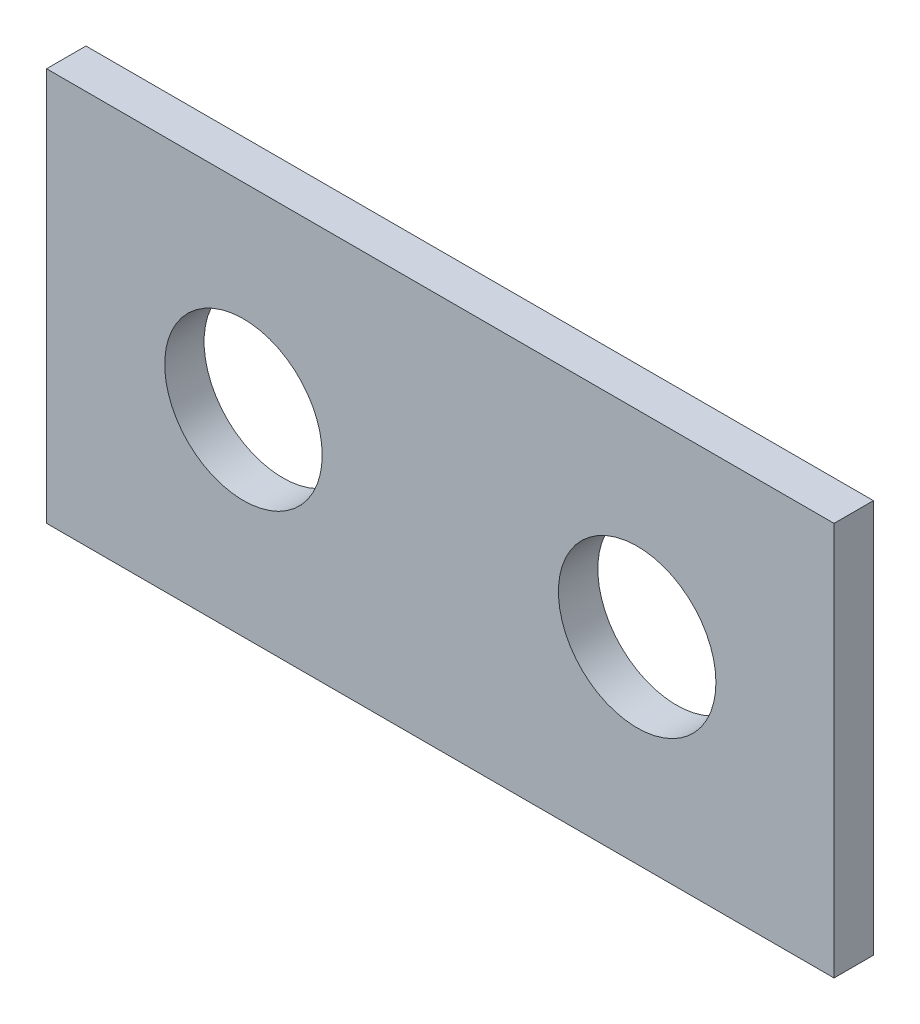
from build123d import *

# Parameters (mm, degrees)
SKETCH1_W       = 100
SKETCH1_H       = 50
EXTRUDE1_DEPTH  = 5
HOLE_1_SKETCH_R = 10
HOLE_1_DEPTH    = 57.124860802
HOLE_2_SKETCH_R = 10
HOLE_2_DEPTH    = 57.124860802


with BuildPart() as part:
    # Sketch1 → Extrude1 (new body)
    with BuildSketch(Plane.XY):
        Rectangle(SKETCH1_W, SKETCH1_H)
    extrude(amount=EXTRUDE1_DEPTH)

    # hole 1 sketch → hole 1 (cut, through all)
    with BuildSketch(Plane.XY.offset(5)):
        with Locations((25, 0)):
            Circle(HOLE_1_SKETCH_R)
    extrude(amount=-HOLE_1_DEPTH, mode=Mode.SUBTRACT)

    # hole 2 sketch → hole 2 (cut, through all)
    with BuildSketch(Plane.XY.offset(5)):
        with Locations((-25, 0)):
            Circle(HOLE_2_SKETCH_R)
    extrude(amount=-HOLE_2_DEPTH, mode=Mode.SUBTRACT)


solid = part.part
